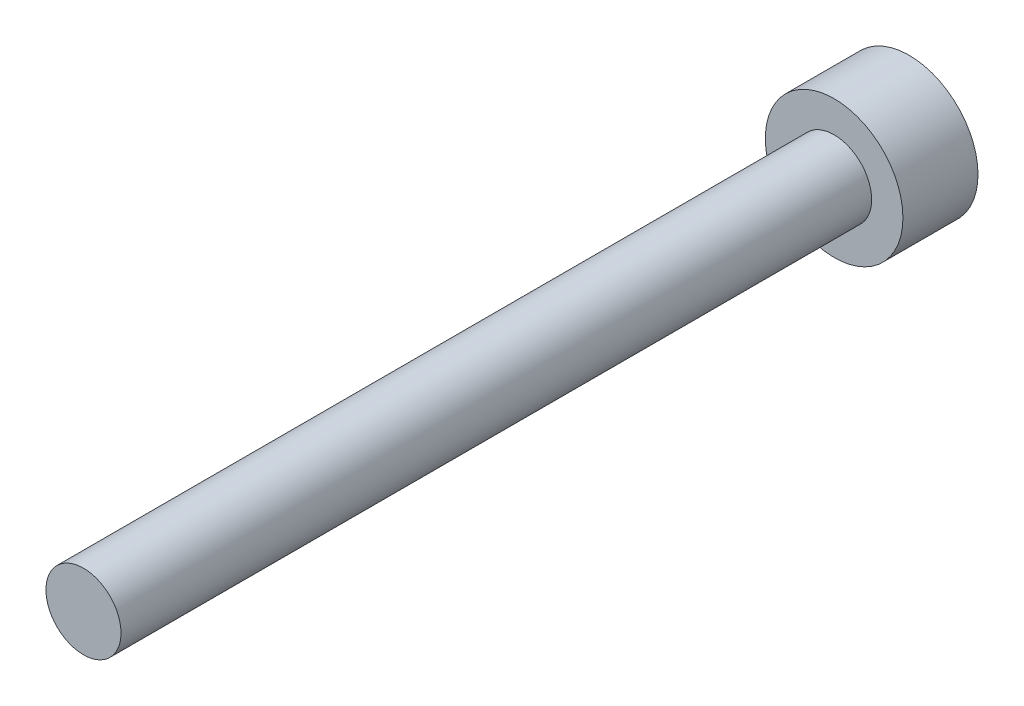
from build123d import *

# Parameters (mm, degrees)
HEAD_ENVELOPE_START             = -3
SKETCH_1_R                      = 2.75
HEAD_ENVELOPE_DEPTH             = 3
SKETCH_2_R                      = 1.5
SHANK_ENVELOPE_NO_THREADS_DEPTH = 30


with BuildPart() as part:
    # Sketch 1 → Head_envelope (new body)
    with BuildSketch(Plane.XY.offset(HEAD_ENVELOPE_START)):
        Circle(SKETCH_1_R)
    extrude(amount=HEAD_ENVELOPE_DEPTH)

    # Sketch 2 → Shank_envelope_no_threads (add)
    with BuildSketch(Plane.XY):
        Circle(SKETCH_2_R)
    extrude(amount=SHANK_ENVELOPE_NO_THREADS_DEPTH)


solid = part.part
